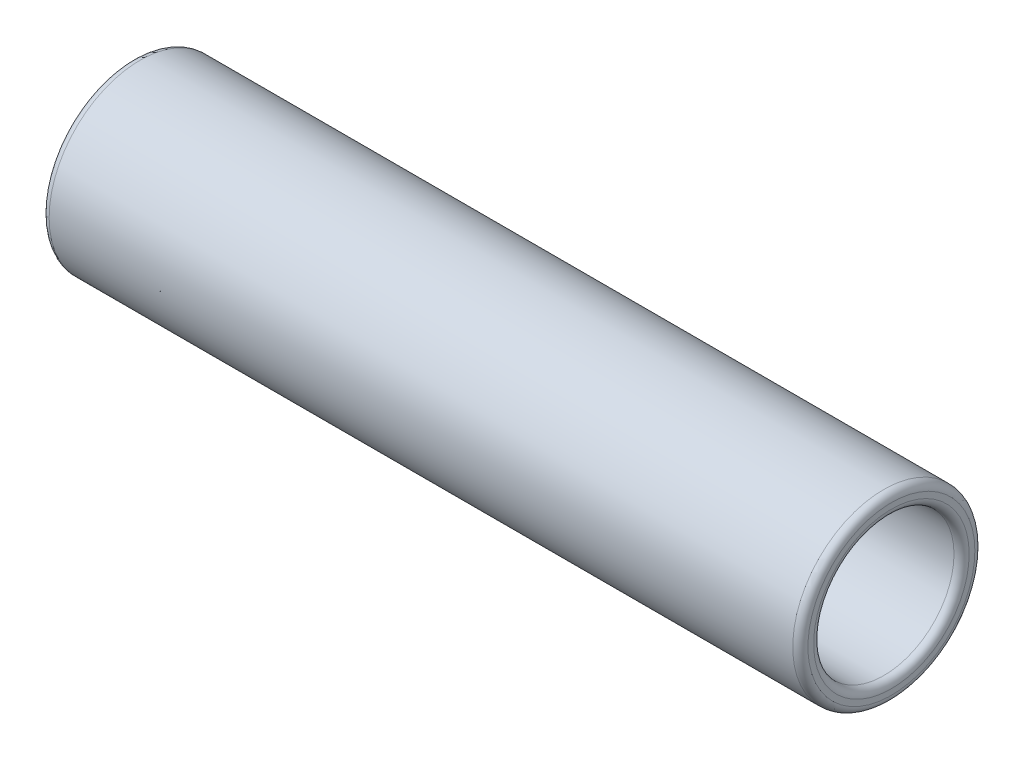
ISO-10303-21;
HEADER;
FILE_DESCRIPTION(('STEP AP214'),'2;1');
FILE_NAME('part.step','',(''),(''),'','','');
FILE_SCHEMA(('AUTOMOTIVE_DESIGN { 1 0 10303 214 1 1 1 1 }'));
ENDSEC;
DATA;
#1=APPLICATION_CONTEXT('core data for automotive mechanical design processes');
#2=APPLICATION_PROTOCOL_DEFINITION('international standard','automotive_design',2000,#1);
#3=PRODUCT_CONTEXT('',#1,'mechanical');
#4=PRODUCT('Part','Part','',(#3));
#5=PRODUCT_RELATED_PRODUCT_CATEGORY('part','',(#4));
#6=PRODUCT_DEFINITION_FORMATION('','',#4);
#7=PRODUCT_DEFINITION_CONTEXT('part definition',#1,'design');
#8=PRODUCT_DEFINITION('design','',#6,#7);
#9=PRODUCT_DEFINITION_SHAPE('','',#8);
#10=(LENGTH_UNIT() NAMED_UNIT(*) SI_UNIT(.MILLI.,.METRE.));
#11=(NAMED_UNIT(*) PLANE_ANGLE_UNIT() SI_UNIT($,.RADIAN.));
#12=(NAMED_UNIT(*) SI_UNIT($,.STERADIAN.) SOLID_ANGLE_UNIT());
#13=UNCERTAINTY_MEASURE_WITH_UNIT(LENGTH_MEASURE(1.E-05),#10,'distance_accuracy_value','');
#14=(GEOMETRIC_REPRESENTATION_CONTEXT(3) GLOBAL_UNCERTAINTY_ASSIGNED_CONTEXT((#13)) GLOBAL_UNIT_ASSIGNED_CONTEXT((#10,
#11,#12)) REPRESENTATION_CONTEXT('',''));
#15=CARTESIAN_POINT('',(0.,0.,0.));
#16=DIRECTION('',(0.,0.,1.));
#17=DIRECTION('',(1.,0.,0.));
#18=AXIS2_PLACEMENT_3D('',#15,#16,#17);
#19=CARTESIAN_POINT('',(7.12917845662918,0.925000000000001,0.));
#20=DIRECTION('',(1.,0.,0.));
#21=DIRECTION('',(0.,0.,-1.));
#22=AXIS2_PLACEMENT_3D('',#19,#20,#21);
#23=PLANE('',#22);
#24=CARTESIAN_POINT('',(7.12917845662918,0.,0.));
#25=DIRECTION('',(1.,0.,0.));
#26=DIRECTION('',(0.,0.,-1.));
#27=AXIS2_PLACEMENT_3D('',#24,#25,#26);
#28=CIRCLE('',#27,1.025);
#29=CARTESIAN_POINT('',(7.12917845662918,0.,-1.025));
#30=VERTEX_POINT('',#29);
#31=EDGE_CURVE('E39',#30,#30,#28,.F.);
#32=ORIENTED_EDGE('',*,*,#31,.T.);
#33=EDGE_LOOP('',(#32));
#34=FACE_BOUND('',#33,.T.);
#35=CARTESIAN_POINT('',(7.12917845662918,0.,0.));
#36=DIRECTION('',(1.,0.,0.));
#37=DIRECTION('',(0.,0.,-1.));
#38=AXIS2_PLACEMENT_3D('',#35,#36,#37);
#39=CIRCLE('',#38,1.1);
#40=CARTESIAN_POINT('',(7.12917845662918,0.,-1.1));
#41=VERTEX_POINT('',#40);
#42=EDGE_CURVE('E43',#41,#41,#39,.T.);
#43=ORIENTED_EDGE('',*,*,#42,.T.);
#44=EDGE_LOOP('',(#43));
#45=FACE_BOUND('',#44,.T.);
#46=ADVANCED_FACE('F29',(#34,#45),#23,.T.);
#47=CARTESIAN_POINT('',(0.,0.,0.));
#48=DIRECTION('',(1.,0.,0.));
#49=DIRECTION('',(0.,0.,-1.));
#50=AXIS2_PLACEMENT_3D('',#47,#48,#49);
#51=CYLINDRICAL_SURFACE('',#50,1.2);
#52=CARTESIAN_POINT('',(7.02917845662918,0.,0.));
#53=DIRECTION('',(1.,0.,0.));
#54=DIRECTION('',(0.,0.,-1.));
#55=AXIS2_PLACEMENT_3D('',#52,#53,#54);
#56=CIRCLE('',#55,1.2);
#57=CARTESIAN_POINT('',(7.02917845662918,0.,-1.2));
#58=VERTEX_POINT('',#57);
#59=EDGE_CURVE('E10',#58,#58,#56,.F.);
#60=ORIENTED_EDGE('',*,*,#59,.T.);
#61=EDGE_LOOP('',(#60));
#62=FACE_BOUND('',#61,.T.);
#63=CARTESIAN_POINT('',(-2.77082154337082,0.,0.));
#64=DIRECTION('',(-1.,0.,0.));
#65=DIRECTION('',(0.,0.,1.));
#66=AXIS2_PLACEMENT_3D('',#63,#64,#65);
#67=CIRCLE('',#66,1.2);
#68=CARTESIAN_POINT('',(-2.77082154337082,0.,1.2));
#69=VERTEX_POINT('',#68);
#70=EDGE_CURVE('E35',#69,#69,#67,.F.);
#71=ORIENTED_EDGE('',*,*,#70,.T.);
#72=EDGE_LOOP('',(#71));
#73=FACE_BOUND('',#72,.T.);
#74=ADVANCED_FACE('F75',(#62,#73),#51,.T.);
#75=CARTESIAN_POINT('',(-2.87082154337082,0.925,0.));
#76=DIRECTION('',(-1.,0.,0.));
#77=DIRECTION('',(0.,0.,1.));
#78=AXIS2_PLACEMENT_3D('',#75,#76,#77);
#79=PLANE('',#78);
#80=CARTESIAN_POINT('',(-2.87082154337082,0.,0.));
#81=DIRECTION('',(-1.,0.,0.));
#82=DIRECTION('',(0.,0.,1.));
#83=AXIS2_PLACEMENT_3D('',#80,#81,#82);
#84=CIRCLE('',#83,1.025);
#85=CARTESIAN_POINT('',(-2.87082154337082,0.,1.025));
#86=VERTEX_POINT('',#85);
#87=EDGE_CURVE('E54',#86,#86,#84,.F.);
#88=ORIENTED_EDGE('',*,*,#87,.T.);
#89=EDGE_LOOP('',(#88));
#90=FACE_BOUND('',#89,.T.);
#91=CARTESIAN_POINT('',(-2.87082154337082,0.,0.));
#92=DIRECTION('',(-1.,0.,0.));
#93=DIRECTION('',(0.,0.,1.));
#94=AXIS2_PLACEMENT_3D('',#91,#92,#93);
#95=CIRCLE('',#94,1.1);
#96=CARTESIAN_POINT('',(-2.87082154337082,0.,1.1));
#97=VERTEX_POINT('',#96);
#98=EDGE_CURVE('E57',#97,#97,#95,.T.);
#99=ORIENTED_EDGE('',*,*,#98,.T.);
#100=EDGE_LOOP('',(#99));
#101=FACE_BOUND('',#100,.T.);
#102=ADVANCED_FACE('F61',(#90,#101),#79,.T.);
#103=CARTESIAN_POINT('',(0.,0.,0.));
#104=DIRECTION('',(1.,0.,0.));
#105=DIRECTION('',(0.,0.,-1.));
#106=AXIS2_PLACEMENT_3D('',#103,#104,#105);
#107=CYLINDRICAL_SURFACE('',#106,0.925);
#108=CARTESIAN_POINT('',(-2.77082154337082,0.,0.));
#109=DIRECTION('',(-1.,0.,0.));
#110=DIRECTION('',(0.,0.,1.));
#111=AXIS2_PLACEMENT_3D('',#108,#109,#110);
#112=CIRCLE('',#111,0.925);
#113=CARTESIAN_POINT('',(-2.77082154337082,0.,0.925));
#114=VERTEX_POINT('',#113);
#115=EDGE_CURVE('E48',#114,#114,#112,.T.);
#116=ORIENTED_EDGE('',*,*,#115,.T.);
#117=EDGE_LOOP('',(#116));
#118=FACE_BOUND('',#117,.T.);
#119=CARTESIAN_POINT('',(7.02917845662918,0.,0.));
#120=DIRECTION('',(1.,0.,0.));
#121=DIRECTION('',(0.,0.,-1.));
#122=AXIS2_PLACEMENT_3D('',#119,#120,#121);
#123=CIRCLE('',#122,0.925);
#124=CARTESIAN_POINT('',(7.02917845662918,0.,-0.925));
#125=VERTEX_POINT('',#124);
#126=EDGE_CURVE('E51',#125,#125,#123,.T.);
#127=ORIENTED_EDGE('',*,*,#126,.T.);
#128=EDGE_LOOP('',(#127));
#129=FACE_BOUND('',#128,.T.);
#130=ADVANCED_FACE('F91',(#118,#129),#107,.F.);
#131=CARTESIAN_POINT('',(-2.77082154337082,0.,0.));
#132=DIRECTION('',(-1.,0.,0.));
#133=DIRECTION('',(0.,0.,1.));
#134=AXIS2_PLACEMENT_3D('',#131,#132,#133);
#135=TOROIDAL_SURFACE('',#134,1.025,0.1);
#136=ORIENTED_EDGE('',*,*,#115,.F.);
#137=EDGE_LOOP('',(#136));
#138=FACE_BOUND('',#137,.T.);
#139=ORIENTED_EDGE('',*,*,#87,.F.);
#140=EDGE_LOOP('',(#139));
#141=FACE_BOUND('',#140,.T.);
#142=ADVANCED_FACE('F87',(#138,#141),#135,.T.);
#143=CARTESIAN_POINT('',(7.02917845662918,0.,0.));
#144=DIRECTION('',(1.,0.,0.));
#145=DIRECTION('',(0.,0.,-1.));
#146=AXIS2_PLACEMENT_3D('',#143,#144,#145);
#147=TOROIDAL_SURFACE('',#146,1.025,0.1);
#148=ORIENTED_EDGE('',*,*,#31,.F.);
#149=EDGE_LOOP('',(#148));
#150=FACE_BOUND('',#149,.T.);
#151=ORIENTED_EDGE('',*,*,#126,.F.);
#152=EDGE_LOOP('',(#151));
#153=FACE_BOUND('',#152,.T.);
#154=ADVANCED_FACE('F71',(#150,#153),#147,.T.);
#155=CARTESIAN_POINT('',(7.02917845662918,0.,0.));
#156=DIRECTION('',(1.,0.,0.));
#157=DIRECTION('',(0.,0.,-1.));
#158=AXIS2_PLACEMENT_3D('',#155,#156,#157);
#159=TOROIDAL_SURFACE('',#158,1.1,0.1);
#160=ORIENTED_EDGE('',*,*,#59,.F.);
#161=EDGE_LOOP('',(#160));
#162=FACE_BOUND('',#161,.T.);
#163=ORIENTED_EDGE('',*,*,#42,.F.);
#164=EDGE_LOOP('',(#163));
#165=FACE_BOUND('',#164,.T.);
#166=ADVANCED_FACE('F66',(#162,#165),#159,.T.);
#167=CARTESIAN_POINT('',(-2.77082154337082,0.,0.));
#168=DIRECTION('',(-1.,0.,0.));
#169=DIRECTION('',(0.,0.,1.));
#170=AXIS2_PLACEMENT_3D('',#167,#168,#169);
#171=TOROIDAL_SURFACE('',#170,1.1,0.1);
#172=ORIENTED_EDGE('',*,*,#98,.F.);
#173=EDGE_LOOP('',(#172));
#174=FACE_BOUND('',#173,.T.);
#175=ORIENTED_EDGE('',*,*,#70,.F.);
#176=EDGE_LOOP('',(#175));
#177=FACE_BOUND('',#176,.T.);
#178=ADVANCED_FACE('F63',(#174,#177),#171,.T.);
#179=CLOSED_SHELL('',(#46,#74,#102,#130,#142,#154,#166,#178));
#180=MANIFOLD_SOLID_BREP('B2',#179);
#181=ADVANCED_BREP_SHAPE_REPRESENTATION('',(#18,#180),#14);
#182=SHAPE_DEFINITION_REPRESENTATION(#9,#181);
ENDSEC;
END-ISO-10303-21;
